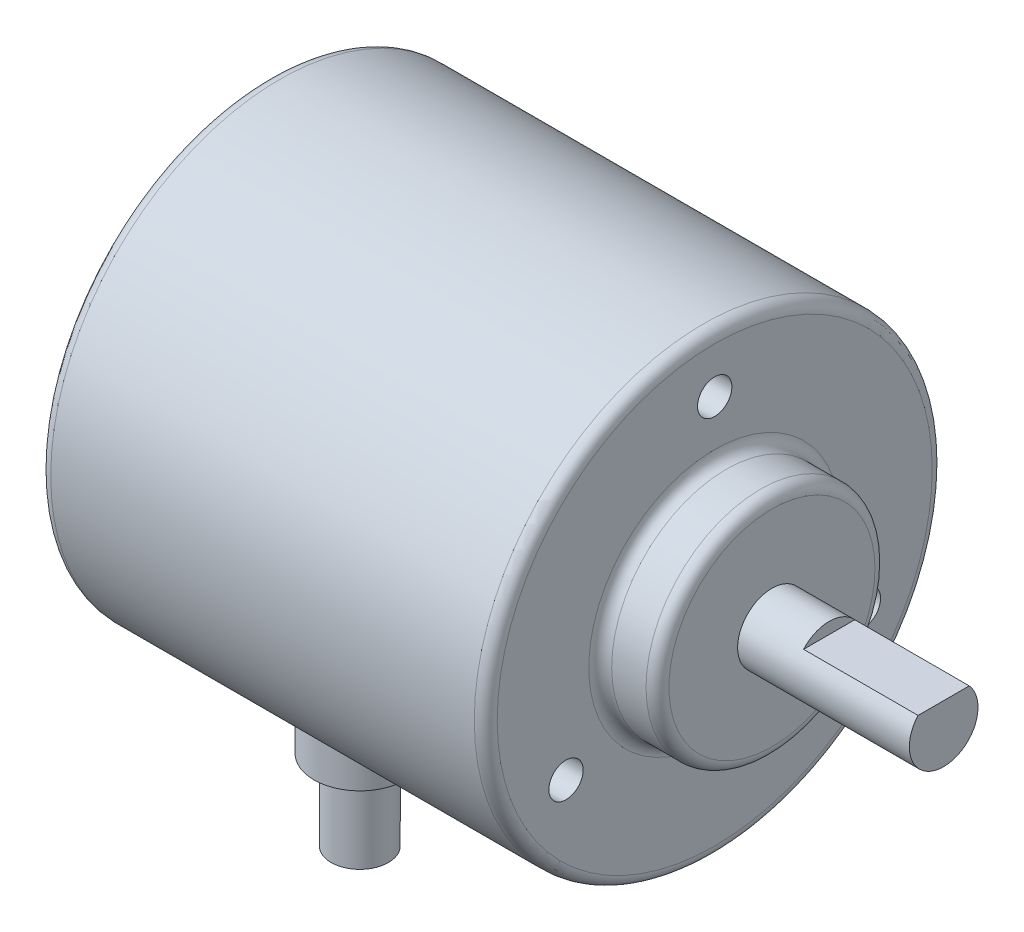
ISO-10303-21;
HEADER;
FILE_DESCRIPTION(('STEP AP214'),'2;1');
FILE_NAME('part.step','',(''),(''),'','','');
FILE_SCHEMA(('AUTOMOTIVE_DESIGN { 1 0 10303 214 1 1 1 1 }'));
ENDSEC;
DATA;
#1=APPLICATION_CONTEXT('core data for automotive mechanical design processes');
#2=APPLICATION_PROTOCOL_DEFINITION('international standard','automotive_design',2000,#1);
#3=PRODUCT_CONTEXT('',#1,'mechanical');
#4=PRODUCT('Part','Part','',(#3));
#5=PRODUCT_RELATED_PRODUCT_CATEGORY('part','',(#4));
#6=PRODUCT_DEFINITION_FORMATION('','',#4);
#7=PRODUCT_DEFINITION_CONTEXT('part definition',#1,'design');
#8=PRODUCT_DEFINITION('design','',#6,#7);
#9=PRODUCT_DEFINITION_SHAPE('','',#8);
#10=(LENGTH_UNIT() NAMED_UNIT(*) SI_UNIT(.MILLI.,.METRE.));
#11=(NAMED_UNIT(*) PLANE_ANGLE_UNIT() SI_UNIT($,.RADIAN.));
#12=(NAMED_UNIT(*) SI_UNIT($,.STERADIAN.) SOLID_ANGLE_UNIT());
#13=UNCERTAINTY_MEASURE_WITH_UNIT(LENGTH_MEASURE(1.E-05),#10,'distance_accuracy_value','');
#14=(GEOMETRIC_REPRESENTATION_CONTEXT(3) GLOBAL_UNCERTAINTY_ASSIGNED_CONTEXT((#13)) GLOBAL_UNIT_ASSIGNED_CONTEXT((#10,
#11,#12)) REPRESENTATION_CONTEXT('',''));
#15=CARTESIAN_POINT('',(0.,0.,0.));
#16=DIRECTION('',(0.,0.,1.));
#17=DIRECTION('',(1.,0.,0.));
#18=AXIS2_PLACEMENT_3D('',#15,#16,#17);
#19=CARTESIAN_POINT('',(39.,0.,0.));
#20=DIRECTION('',(-1.,0.,0.));
#21=DIRECTION('',(0.,0.,1.));
#22=AXIS2_PLACEMENT_3D('',#19,#20,#21);
#23=CYLINDRICAL_SURFACE('',#22,20.);
#24=CARTESIAN_POINT('',(1.,0.,0.));
#25=DIRECTION('',(1.,0.,0.));
#26=DIRECTION('',(0.,0.,-1.));
#27=AXIS2_PLACEMENT_3D('',#24,#25,#26);
#28=CIRCLE('',#27,20.);
#29=CARTESIAN_POINT('',(1.,0.,-20.));
#30=VERTEX_POINT('',#29);
#31=EDGE_CURVE('E170',#30,#30,#28,.T.);
#32=ORIENTED_EDGE('',*,*,#31,.T.);
#33=EDGE_LOOP('',(#32));
#34=FACE_BOUND('',#33,.T.);
#35=CARTESIAN_POINT('',(38.,0.,0.));
#36=DIRECTION('',(1.,0.,0.));
#37=DIRECTION('',(0.,0.,-1.));
#38=AXIS2_PLACEMENT_3D('',#35,#36,#37);
#39=CIRCLE('',#38,20.);
#40=CARTESIAN_POINT('',(38.,0.,-20.));
#41=VERTEX_POINT('',#40);
#42=EDGE_CURVE('E84',#41,#41,#39,.F.);
#43=ORIENTED_EDGE('',*,*,#42,.T.);
#44=EDGE_LOOP('',(#43));
#45=FACE_BOUND('',#44,.T.);
#46=CARTESIAN_POINT('',(9.28562013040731,-19.4633866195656,-4.60180196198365));
#47=CARTESIAN_POINT('',(9.07526862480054,-19.6404124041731,-3.85306889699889));
#48=CARTESIAN_POINT('',(9.02849610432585,-20.4365559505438,-3.86551364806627));
#49=CARTESIAN_POINT('',(9.01511911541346,-19.4471816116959,-4.67034633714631));
#50=CARTESIAN_POINT('',(8.85078145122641,-19.6284085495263,-3.91559139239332));
#51=CARTESIAN_POINT('',(8.81209529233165,-20.4195406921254,-3.92309092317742));
#52=CARTESIAN_POINT('',(8.73825597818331,-19.435737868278,-4.7172765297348));
#53=CARTESIAN_POINT('',(8.61888226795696,-19.6197970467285,-3.95891404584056));
#54=CARTESIAN_POINT('',(8.59060478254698,-20.4075247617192,-3.96251228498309));
#55=CARTESIAN_POINT('',(8.17994843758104,-19.423775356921,-4.76630042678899));
#56=CARTESIAN_POINT('',(8.15121764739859,-19.6108256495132,-4.00401183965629));
#57=CARTESIAN_POINT('',(8.1439587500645,-20.3949641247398,-4.00369235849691));
#58=CARTESIAN_POINT('',(7.89850476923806,-19.4232548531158,-4.7684012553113));
#59=CARTESIAN_POINT('',(7.91461822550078,-19.6104320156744,-4.00595672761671));
#60=CARTESIAN_POINT('',(7.91880381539,-20.3944175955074,-4.00545705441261));
#61=CARTESIAN_POINT('',(7.345971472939,-19.4330800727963,-4.72818962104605));
#62=CARTESIAN_POINT('',(7.4516628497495,-19.6178031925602,-3.96895813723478));
#63=CARTESIAN_POINT('',(7.47677717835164,-20.4047340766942,-3.97167928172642));
#64=CARTESIAN_POINT('',(7.07479322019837,-19.4431735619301,-4.68690812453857));
#65=CARTESIAN_POINT('',(7.22439344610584,-19.6254041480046,-3.93083578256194));
#66=CARTESIAN_POINT('',(7.25983457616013,-20.4153322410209,-3.93700282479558));
#67=CARTESIAN_POINT('',(6.54369398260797,-19.4726505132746,-4.56288303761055));
#68=CARTESIAN_POINT('',(6.78195391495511,-19.6473341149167,-3.81728972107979));
#69=CARTESIAN_POINT('',(6.83495518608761,-20.4462830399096,-3.83282175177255));
#70=CARTESIAN_POINT('',(6.28377356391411,-19.4920344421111,-4.48013736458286));
#71=CARTESIAN_POINT('',(6.5661448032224,-19.6617314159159,-3.74150011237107));
#72=CARTESIAN_POINT('',(6.62701885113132,-20.4666361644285,-3.76331538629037));
#73=CARTESIAN_POINT('',(5.78051878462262,-19.5380404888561,-4.27504684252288));
#74=CARTESIAN_POINT('',(6.15180958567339,-19.6953707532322,-3.55567595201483));
#75=CARTESIAN_POINT('',(6.22441502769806,-20.5149425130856,-3.59103934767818));
#76=CARTESIAN_POINT('',(5.53730488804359,-19.56470942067,-4.15244487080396));
#77=CARTESIAN_POINT('',(5.95302967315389,-19.7147248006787,-3.44491318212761));
#78=CARTESIAN_POINT('',(6.02984391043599,-20.5429448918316,-3.48805369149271));
#79=CARTESIAN_POINT('',(5.07559252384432,-19.6222761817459,-3.87127991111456));
#80=CARTESIAN_POINT('',(5.57963786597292,-19.7557247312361,-3.19414913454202));
#81=CARTESIAN_POINT('',(5.66047401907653,-20.6033899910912,-3.25187512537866));
#82=CARTESIAN_POINT('',(4.85709800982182,-19.6531746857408,-3.71271118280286));
#83=CARTESIAN_POINT('',(5.40495883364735,-19.7774294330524,-3.05362977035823));
#84=CARTESIAN_POINT('',(5.48567840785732,-20.6358334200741,-3.11867739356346));
#85=CARTESIAN_POINT('',(4.44503296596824,-19.7167082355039,-3.35922886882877));
#86=CARTESIAN_POINT('',(5.07940206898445,-19.8211458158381,-2.744787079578));
#87=CARTESIAN_POINT('',(5.15602637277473,-20.7025436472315,-2.82175224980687));
#88=CARTESIAN_POINT('',(4.25225796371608,-19.7493675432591,-3.16347766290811));
#89=CARTESIAN_POINT('',(4.92955389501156,-19.8431548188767,-2.57549055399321));
#90=CARTESIAN_POINT('',(5.00180637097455,-20.7368359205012,-2.65732123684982));
#91=CARTESIAN_POINT('',(3.90371575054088,-19.8120459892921,-2.74368403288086));
#92=CARTESIAN_POINT('',(4.66198800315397,-19.8844891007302,-2.21791230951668));
#93=CARTESIAN_POINT('',(4.72297260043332,-20.8026482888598,-2.30469458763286));
#94=CARTESIAN_POINT('',(3.74795016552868,-19.8420650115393,-2.51964036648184));
#95=CARTESIAN_POINT('',(4.54475774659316,-19.9037666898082,-2.0295319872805));
#96=CARTESIAN_POINT('',(4.59836013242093,-20.8341682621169,-2.1164979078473));
#97=CARTESIAN_POINT('',(3.47713911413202,-19.8962976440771,-2.04791196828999));
#98=CARTESIAN_POINT('',(4.3431121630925,-19.9379415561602,-1.63839581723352));
#99=CARTESIAN_POINT('',(4.38171129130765,-20.8911125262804,-1.72024605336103));
#100=CARTESIAN_POINT('',(3.36232578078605,-19.9204779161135,-1.80010226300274));
#101=CARTESIAN_POINT('',(4.25947522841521,-19.9527264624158,-1.43585830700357));
#102=CARTESIAN_POINT('',(4.2898606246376,-20.9165018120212,-1.51208590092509));
#103=CARTESIAN_POINT('',(3.17829264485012,-19.9600682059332,-1.28891716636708));
#104=CARTESIAN_POINT('',(4.12625139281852,-19.9766419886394,-1.02242100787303));
#105=CARTESIAN_POINT('',(4.14263411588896,-20.9580716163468,-1.08269041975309));
#106=CARTESIAN_POINT('',(3.1090652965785,-19.975479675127,-1.02554435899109));
#107=CARTESIAN_POINT('',(4.07716796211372,-19.9856858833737,-0.812174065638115));
#108=CARTESIAN_POINT('',(4.08725223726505,-20.9742536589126,-0.861457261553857));
#109=CARTESIAN_POINT('',(3.01954989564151,-19.995532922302,-0.497015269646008));
#110=CARTESIAN_POINT('',(4.01365033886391,-19.9974391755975,-0.392164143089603));
#111=CARTESIAN_POINT('',(4.01563991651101,-20.9953095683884,-0.417492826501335));
#112=CARTESIAN_POINT('',(2.99820226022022,-20.000407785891,-0.232030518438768));
#113=CARTESIAN_POINT('',(3.99873302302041,-20.0002365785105,-0.18333906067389));
#114=CARTESIAN_POINT('',(3.99856180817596,-21.0004281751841,-0.194905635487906));
#115=CARTESIAN_POINT('',(3.0020347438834,-19.9995384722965,0.297599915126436));
#116=CARTESIAN_POINT('',(4.00143376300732,-19.9997322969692,0.23510088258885));
#117=CARTESIAN_POINT('',(4.00162779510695,-20.9995153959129,0.249983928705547));
#118=CARTESIAN_POINT('',(3.02721039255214,-19.9937953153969,0.562245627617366));
#119=CARTESIAN_POINT('',(4.0190367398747,-19.9964334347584,0.443781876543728));
#120=CARTESIAN_POINT('',(4.02176831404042,-20.9934850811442,0.472286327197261));
#121=CARTESIAN_POINT('',(3.12248077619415,-19.9725009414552,1.0794540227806));
#122=CARTESIAN_POINT('',(4.08672604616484,-19.9839289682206,0.855246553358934));
#123=CARTESIAN_POINT('',(4.0979846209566,-20.9711259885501,0.906741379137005));
#124=CARTESIAN_POINT('',(3.19187955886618,-19.9571017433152,1.33213986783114));
#125=CARTESIAN_POINT('',(4.13603165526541,-19.9748657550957,1.0572510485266));
#126=CARTESIAN_POINT('',(4.15350364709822,-20.9549568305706,1.1189974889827));
#127=CARTESIAN_POINT('',(3.3727531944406,-19.9182841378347,1.82279291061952));
#128=CARTESIAN_POINT('',(4.26710519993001,-19.951380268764,1.45445988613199));
#129=CARTESIAN_POINT('',(4.29820255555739,-20.9141983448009,1.53114604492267));
#130=CARTESIAN_POINT('',(3.48423087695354,-19.8948651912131,2.06075911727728));
#131=CARTESIAN_POINT('',(4.34841554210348,-19.9370364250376,1.64909625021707));
#132=CARTESIAN_POINT('',(4.38738470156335,-20.8896084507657,1.73103765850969));
#133=CARTESIAN_POINT('',(3.74789810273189,-19.8420880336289,2.51904009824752));
#134=CARTESIAN_POINT('',(4.54475296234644,-19.9037739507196,2.02910129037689));
#135=CARTESIAN_POINT('',(4.59831848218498,-20.8341924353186,2.11599368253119));
#136=CARTESIAN_POINT('',(3.90065003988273,-19.8126492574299,2.7390518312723));
#137=CARTESIAN_POINT('',(4.65972027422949,-19.8848698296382,2.21406700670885));
#138=CARTESIAN_POINT('',(4.72052003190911,-20.8032817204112,2.30080353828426));
#139=CARTESIAN_POINT('',(4.24192395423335,-19.751176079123,3.15193490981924));
#140=CARTESIAN_POINT('',(4.92160104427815,-19.844354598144,2.56563561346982));
#141=CARTESIAN_POINT('',(4.99353916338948,-20.7387348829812,2.64762532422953));
#142=CARTESIAN_POINT('',(4.43045581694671,-19.7191409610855,3.34479872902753));
#143=CARTESIAN_POINT('',(5.06806184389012,-19.8227882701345,2.73232262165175));
#144=CARTESIAN_POINT('',(5.14436465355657,-20.7050980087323,2.80963093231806));
#145=CARTESIAN_POINT('',(4.84315154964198,-19.6551526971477,3.70254257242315));
#146=CARTESIAN_POINT('',(5.39376102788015,-19.7788232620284,3.04457764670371));
#147=CARTESIAN_POINT('',(5.47452123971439,-20.6379103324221,3.11013576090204));
#148=CARTESIAN_POINT('',(5.06804558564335,-19.623218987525,3.86666271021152));
#149=CARTESIAN_POINT('',(5.57347444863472,-19.7564019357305,3.1899943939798));
#150=CARTESIAN_POINT('',(5.65443646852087,-20.6043799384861,3.24799667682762));
#151=CARTESIAN_POINT('',(5.5440643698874,-19.5638648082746,4.15658248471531));
#152=CARTESIAN_POINT('',(5.95843706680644,-19.7141306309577,3.44855996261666));
#153=CARTESIAN_POINT('',(6.03525149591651,-20.5420580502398,3.49152928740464));
#154=CARTESIAN_POINT('',(5.79517240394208,-19.5364414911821,4.28240634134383));
#155=CARTESIAN_POINT('',(6.16374622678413,-19.6942151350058,3.56229087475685));
#156=CARTESIAN_POINT('',(6.23613792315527,-20.5132635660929,3.59722132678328));
#157=CARTESIAN_POINT('',(6.26971361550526,-19.4935541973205,4.47315270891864));
#158=CARTESIAN_POINT('',(6.55487216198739,-19.6628136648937,3.73531230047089));
#159=CARTESIAN_POINT('',(6.61577089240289,-20.468231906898,3.75744827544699));
#160=CARTESIAN_POINT('',(6.49000023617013,-19.4768263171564,4.54495880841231));
#161=CARTESIAN_POINT('',(6.73758767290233,-19.6504188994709,3.8009584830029));
#162=CARTESIAN_POINT('',(6.79200018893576,-20.4506676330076,3.8177653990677));
#163=CARTESIAN_POINT('',(6.93932279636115,-19.4499131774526,4.65878783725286));
#164=CARTESIAN_POINT('',(7.11150259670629,-19.6304258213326,3.90507561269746));
#165=CARTESIAN_POINT('',(7.1514582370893,-20.4224088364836,3.91338178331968));
#166=CARTESIAN_POINT('',(7.16835789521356,-19.4397272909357,4.70081362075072));
#167=CARTESIAN_POINT('',(7.30307740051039,-19.62278340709,3.94378628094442));
#168=CARTESIAN_POINT('',(7.33468631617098,-20.411713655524,3.94868344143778));
#169=CARTESIAN_POINT('',(7.67222074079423,-19.4256149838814,4.75884978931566));
#170=CARTESIAN_POINT('',(7.72478026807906,-19.6122139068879,3.99712496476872));
#171=CARTESIAN_POINT('',(7.73777659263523,-20.3968957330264,3.99743382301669));
#172=CARTESIAN_POINT('',(7.94788406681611,-19.4231415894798,4.76883110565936));
#173=CARTESIAN_POINT('',(7.95645628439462,-19.6103427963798,4.00636875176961));
#174=CARTESIAN_POINT('',(7.95830725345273,-20.3942986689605,4.0058181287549));
#175=CARTESIAN_POINT('',(8.49715233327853,-19.4288428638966,4.7455424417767));
#176=CARTESIAN_POINT('',(8.4168785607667,-19.6146226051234,3.98493366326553));
#177=CARTESIAN_POINT('',(8.39772186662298,-20.4002850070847,3.98625565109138));
#178=CARTESIAN_POINT('',(8.77075621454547,-19.4370226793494,4.71225155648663));
#179=CARTESIAN_POINT('',(8.64642951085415,-19.6207924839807,3.95416019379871));
#180=CARTESIAN_POINT('',(8.61660497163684,-20.4088738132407,3.95829130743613));
#181=CARTESIAN_POINT('',(9.3077885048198,-19.463051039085,4.60355569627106));
#182=CARTESIAN_POINT('',(9.09450727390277,-19.6402009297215,3.85451219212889));
#183=CARTESIAN_POINT('',(9.04623080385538,-20.4362035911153,3.86698678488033));
#184=CARTESIAN_POINT('',(9.57122542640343,-19.4808912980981,4.52818680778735));
#185=CARTESIAN_POINT('',(9.31372849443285,-19.6534958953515,3.78534178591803));
#186=CARTESIAN_POINT('',(9.25698034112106,-20.4549358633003,3.80367691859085));
#187=CARTESIAN_POINT('',(10.0809871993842,-19.5241802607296,4.33772502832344));
#188=CARTESIAN_POINT('',(9.7345255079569,-19.6852714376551,3.61237270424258));
#189=CARTESIAN_POINT('',(9.66478975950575,-20.5003892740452,3.64368902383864));
#190=CARTESIAN_POINT('',(10.3273113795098,-19.5496292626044,4.22263058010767));
#191=CARTESIAN_POINT('',(9.93654001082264,-19.7038336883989,3.50808176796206));
#192=CARTESIAN_POINT('',(9.86184910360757,-20.5271107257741,3.54700968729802));
#193=CARTESIAN_POINT('',(10.799753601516,-19.6057016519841,3.9541696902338));
#194=CARTESIAN_POINT('',(10.3200904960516,-19.7439959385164,3.26782748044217));
#195=CARTESIAN_POINT('',(10.2398028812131,-20.5859867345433,3.3215025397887));
#196=CARTESIAN_POINT('',(11.0255438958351,-19.6363919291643,3.80029442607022));
#197=CARTESIAN_POINT('',(10.501412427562,-19.7656987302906,3.13092303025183));
#198=CARTESIAN_POINT('',(10.4204351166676,-20.6182115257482,3.19224731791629));
#199=CARTESIAN_POINT('',(11.4472282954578,-19.6993255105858,3.45927398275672));
#200=CARTESIAN_POINT('',(10.8360409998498,-19.8092883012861,2.83181226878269));
#201=CARTESIAN_POINT('',(10.7577826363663,-20.6842917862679,2.90579014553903));
#202=CARTESIAN_POINT('',(11.6431182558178,-19.731569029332,3.27212419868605));
#203=CARTESIAN_POINT('',(10.989158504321,-19.8311952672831,2.66918633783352));
#204=CARTESIAN_POINT('',(10.9144946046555,-20.7181474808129,2.74858432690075));
#205=CARTESIAN_POINT('',(12.0038288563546,-19.7948311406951,2.86495214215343));
#206=CARTESIAN_POINT('',(11.267665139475,-19.87326956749,2.32058440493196));
#207=CARTESIAN_POINT('',(11.2030630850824,-20.7845726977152,2.40655979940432));
#208=CARTESIAN_POINT('',(12.1678736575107,-19.8258073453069,2.64429880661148));
#209=CARTESIAN_POINT('',(11.3918811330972,-19.8933449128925,2.13405636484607));
#210=CARTESIAN_POINT('',(11.3342989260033,-20.8170977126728,2.22121099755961));
#211=CARTESIAN_POINT('',(12.4547003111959,-19.8822974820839,2.1792280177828));
#212=CARTESIAN_POINT('',(11.6066309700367,-19.9292369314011,1.74656527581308));
#213=CARTESIAN_POINT('',(11.5637602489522,-20.8764123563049,1.83055153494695));
#214=CARTESIAN_POINT('',(12.5774843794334,-19.9078117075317,1.93481184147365));
#215=CARTESIAN_POINT('',(11.6965821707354,-19.9449715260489,1.54581400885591));
#216=CARTESIAN_POINT('',(11.6619875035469,-20.9032022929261,1.62524194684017));
#217=CARTESIAN_POINT('',(12.777166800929,-19.9503210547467,1.43108444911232));
#218=CARTESIAN_POINT('',(11.8417991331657,-19.9708288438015,1.13675150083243));
#219=CARTESIAN_POINT('',(11.8217334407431,-20.9478371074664,1.20211093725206));
#220=CARTESIAN_POINT('',(12.8544285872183,-19.9673834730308,1.17190983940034));
#221=CARTESIAN_POINT('',(11.896818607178,-19.9809080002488,0.929080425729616));
#222=CARTESIAN_POINT('',(11.8835428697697,-20.9657526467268,0.984404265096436));
#223=CARTESIAN_POINT('',(12.9620249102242,-19.9913566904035,0.644428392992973));
#224=CARTESIAN_POINT('',(11.9733913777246,-19.9950211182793,0.508833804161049));
#225=CARTESIAN_POINT('',(11.9696199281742,-20.990924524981,0.541319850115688));
#226=CARTESIAN_POINT('',(12.992367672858,-19.9982692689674,0.376123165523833));
#227=CARTESIAN_POINT('',(11.9946224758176,-19.9989962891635,0.297116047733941));
#228=CARTESIAN_POINT('',(11.9938941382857,-20.9981827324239,0.315943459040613));
#229=CARTESIAN_POINT('',(13.0049382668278,-20.0011198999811,-0.154972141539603));
#230=CARTESIAN_POINT('',(12.0034813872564,-20.000649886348,-0.122524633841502));
#231=CARTESIAN_POINT('',(12.0039506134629,-21.0011758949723,-0.130176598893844));
#232=CARTESIAN_POINT('',(12.988325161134,-19.9973223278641,-0.417736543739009));
#233=CARTESIAN_POINT('',(11.9918793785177,-19.9984726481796,-0.329498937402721));
#234=CARTESIAN_POINT('',(11.990660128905,-20.9971884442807,-0.350898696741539));
#235=CARTESIAN_POINT('',(12.9100250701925,-19.9797384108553,-0.936742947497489));
#236=CARTESIAN_POINT('',(11.93639082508,-19.9881870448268,-0.741471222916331));
#237=CARTESIAN_POINT('',(11.9280200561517,-20.9787253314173,-0.786864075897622));
#238=CARTESIAN_POINT('',(12.8483388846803,-19.965952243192,-1.19298506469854));
#239=CARTESIAN_POINT('',(11.8927375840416,-19.9801217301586,-0.945624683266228));
#240=CARTESIAN_POINT('',(11.8786711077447,-20.9642498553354,-1.00210745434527));
#241=CARTESIAN_POINT('',(12.6821711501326,-19.9299510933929,-1.69091806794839));
#242=CARTESIAN_POINT('',(11.7728374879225,-19.9584810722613,-1.34719728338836));
#243=CARTESIAN_POINT('',(11.7457369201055,-20.9264486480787,-1.42037117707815));
#244=CARTESIAN_POINT('',(12.5778376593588,-19.9077652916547,-1.93265601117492));
#245=CARTESIAN_POINT('',(11.6971427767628,-19.9450013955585,-1.54400754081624));
#246=CARTESIAN_POINT('',(11.6622701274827,-20.903153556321,-1.62343104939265));
#247=CARTESIAN_POINT('',(12.3294866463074,-19.8573093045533,-2.39618244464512));
#248=CARTESIAN_POINT('',(11.5131611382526,-19.9134474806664,-1.92662130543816));
#249=CARTESIAN_POINT('',(11.4635893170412,-20.8501747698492,-2.01279325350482));
#250=CARTESIAN_POINT('',(12.1854637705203,-19.8290382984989,-2.61796823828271));
#251=CARTESIAN_POINT('',(11.4053960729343,-19.8954529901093,-2.11211178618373));
#252=CARTESIAN_POINT('',(11.348371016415,-20.8204902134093,-2.1990933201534));
#253=CARTESIAN_POINT('',(11.8580170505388,-19.7686846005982,-3.04068587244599));
#254=CARTESIAN_POINT('',(11.1555667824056,-19.8560110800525,-2.47022714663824));
#255=CARTESIAN_POINT('',(11.0864136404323,-20.7571188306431,-2.5541761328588));
#256=CARTESIAN_POINT('',(11.6737784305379,-19.736530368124,-3.24103512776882));
#257=CARTESIAN_POINT('',(11.0132511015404,-19.8345451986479,-2.64254106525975));
#258=CARTESIAN_POINT('',(10.9390227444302,-20.7233568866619,-2.72246950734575));
#259=CARTESIAN_POINT('',(11.2728388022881,-19.6724306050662,-3.60978927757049));
#260=CARTESIAN_POINT('',(10.6982936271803,-19.7908076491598,-2.96309481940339));
#261=CARTESIAN_POINT('',(10.6182710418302,-20.6560521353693,-3.03222299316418));
#262=CARTESIAN_POINT('',(11.0561339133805,-19.6404850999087,-3.77819034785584));
#263=CARTESIAN_POINT('',(10.5259465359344,-19.7685375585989,-3.11166947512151));
#264=CARTESIAN_POINT('',(10.4449071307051,-20.6225093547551,-3.17367989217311));
#265=CARTESIAN_POINT('',(10.5923378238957,-19.5798671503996,-4.0808157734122));
#266=CARTESIAN_POINT('',(10.1524421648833,-19.7256294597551,-3.38057040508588));
#267=CARTESIAN_POINT('',(10.0738702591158,-20.558860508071,-3.42788524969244));
#268=CARTESIAN_POINT('',(10.3448300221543,-19.5512526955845,-4.21447379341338));
#269=CARTESIAN_POINT('',(9.95084009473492,-19.7049629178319,-3.50099321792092));
#270=CARTESIAN_POINT('',(9.87586401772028,-20.5288153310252,-3.54015798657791));
#271=CARTESIAN_POINT('',(9.82894404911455,-19.5012486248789,-4.44012848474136));
#272=CARTESIAN_POINT('',(9.52715404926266,-19.6685332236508,-3.70500178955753));
#273=CARTESIAN_POINT('',(9.4631552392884,-20.4763110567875,-3.72970792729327));
#274=CARTESIAN_POINT('',(9.56056861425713,-19.4798580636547,-4.5321306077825));
#275=CARTESIAN_POINT('',(9.30469681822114,-19.652680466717,-3.78917026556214));
#276=CARTESIAN_POINT('',(9.24845489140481,-20.4538509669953,-3.8069897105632));
#277=CARTESIAN_POINT('',(9.28562013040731,-19.4633866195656,-4.60180196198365));
#278=CARTESIAN_POINT('',(9.07526862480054,-19.6404124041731,-3.85306889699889));
#279=CARTESIAN_POINT('',(9.02849610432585,-20.4365559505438,-3.86551364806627));
#280=(BOUNDED_SURFACE() B_SPLINE_SURFACE(3,2,((#46,#47,#48),(#49,#50,#51),(#52,#53,#54),(#55,
#56,#57),(#58,#59,#60),(#61,#62,#63),(#64,#65,#66),(#67,#68,#69),(#70,#71,#72),(#73,#74,#75),
(#76,#77,#78),(#79,#80,#81),(#82,#83,#84),(#85,#86,#87),(#88,#89,#90),(#91,#92,#93),(#94,#95,
#96),(#97,#98,#99),(#100,#101,#102),(#103,#104,#105),(#106,#107,#108),(#109,#110,#111),(#112,
#113,#114),(#115,#116,#117),(#118,#119,#120),(#121,#122,#123),(#124,#125,#126),(#127,#128,#129),
(#130,#131,#132),(#133,#134,#135),(#136,#137,#138),(#139,#140,#141),(#142,#143,#144),(#145,#146,
#147),(#148,#149,#150),(#151,#152,#153),(#154,#155,#156),(#157,#158,#159),(#160,#161,#162),
(#163,#164,#165),(#166,#167,#168),(#169,#170,#171),(#172,#173,#174),(#175,#176,#177),(#178,#179,
#180),(#181,#182,#183),(#184,#185,#186),(#187,#188,#189),(#190,#191,#192),(#193,#194,#195),
(#196,#197,#198),(#199,#200,#201),(#202,#203,#204),(#205,#206,#207),(#208,#209,#210),(#211,#212,
#213),(#214,#215,#216),(#217,#218,#219),(#220,#221,#222),(#223,#224,#225),(#226,#227,#228),
(#229,#230,#231),(#232,#233,#234),(#235,#236,#237),(#238,#239,#240),(#241,#242,#243),(#244,#245,
#246),(#247,#248,#249),(#250,#251,#252),(#253,#254,#255),(#256,#257,#258),(#259,#260,#261),
(#262,#263,#264),(#265,#266,#267),(#268,#269,#270),(#271,#272,#273),(#274,#275,#276),(#277,#278,
#279)),.UNSPECIFIED.,.T.,.F.,.F.) B_SPLINE_SURFACE_WITH_KNOTS((4,2,2,2,2,2,2,2,2,2,2,2,2,2,2,2,
2,2,2,2,2,2,2,2,2,2,2,2,2,2,2,2,2,2,2,2,2,2,4),(3,3),(0.,0.840250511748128,1.68036749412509,
2.5009613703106,3.32159646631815,4.14763438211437,4.97380422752,5.8214499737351,6.6691329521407,
7.52154729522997,8.37382050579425,9.20703852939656,10.0401764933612,10.8605164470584,
11.6809115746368,12.5131041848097,13.3455270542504,14.1974164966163,15.0487660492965,
15.7469795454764,16.4451261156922,17.268678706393,18.0926293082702,18.9158743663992,
19.7391516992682,20.5738509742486,21.4086658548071,22.2617941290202,23.1148765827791,
23.9610526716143,24.8070803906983,25.632408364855,26.4577216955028,27.2801938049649,
28.1027769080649,28.9438972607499,29.7851182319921,30.639295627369,31.4933611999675),(0.,1.),
.UNSPECIFIED.) GEOMETRIC_REPRESENTATION_ITEM() RATIONAL_B_SPLINE_SURFACE(((1.,0.781778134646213,
1.),(1.,0.783896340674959,1.),(1.,0.785381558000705,1.),(1.,0.786933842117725,1.),(1.,
0.787001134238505,1.),(1.,0.785726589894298,1.),(1.,0.784417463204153,1.),(1.,0.780569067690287,
1.),(1.,0.778029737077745,1.),(1.,0.771947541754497,1.),(1.,0.768398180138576,1.),(1.,
0.760652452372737,1.),(1.,0.75645598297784,1.),(1.,0.747726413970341,1.),(1.,0.743187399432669,
1.),(1.,0.734376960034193,1.),(1.,0.730105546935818,1.),(1.,0.722315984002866,1.),(1.,
0.718802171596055,1.),(1.,0.713013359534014,1.),(1.,0.710738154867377,1.),(1.,0.707771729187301,
1.),(1.,0.707046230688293,1.),(1.,0.707175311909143,1.),(1.,0.708029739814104,1.),(1.,
0.711177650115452,1.),(1.,0.713448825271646,1.),(1.,0.71912103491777,1.),(1.,0.722522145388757,
1.),(1.,0.730101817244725,1.),(1.,0.734290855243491,1.),(1.,0.742934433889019,1.),(1.,
0.747389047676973,1.),(1.,0.756187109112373,1.),(1.,0.760525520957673,1.),(1.,0.768511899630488,
1.),(1.,0.77216030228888,1.),(1.,0.777827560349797,1.),(1.,0.780021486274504,1.),(1.,
0.783539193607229,1.),(1.,0.784863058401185,1.),(1.,0.78669579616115,1.),(1.,0.787015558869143,
1.),(1.,0.786276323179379,1.),(1.,0.785216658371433,1.),(1.,0.78182430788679,1.),(1.,
0.77949271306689,1.),(1.,0.773785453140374,1.),(1.,0.770409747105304,1.),(1.,0.762892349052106,
1.),(1.,0.758740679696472,1.),(1.,0.75012710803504,1.),(1.,0.745665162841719,1.),(1.,
0.736810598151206,1.),(1.,0.732421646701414,1.),(1.,0.724337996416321,1.),(1.,0.72064326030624,
1.),(1.,0.714445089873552,1.),(1.,0.711932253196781,1.),(1.,0.708391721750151,1.),(1.,
0.707363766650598,1.),(1.,0.706940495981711,1.),(1.,0.707505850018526,1.),(1.,0.710108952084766,
1.),(1.,0.712146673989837,1.),(1.,0.717420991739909,1.),(1.,0.720653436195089,1.),(1.,
0.727924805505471,1.),(1.,0.731963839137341,1.),(1.,0.74048541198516,1.),(1.,0.744975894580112,
1.),(1.,0.753824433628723,1.),(1.,0.75818247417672,1.),(1.,0.766370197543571,1.),(1.,
0.770190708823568,1.),(1.,0.776818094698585,1.),(1.,0.779625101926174,1.),(1.,0.781778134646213,1.))) REPRESENTATION_ITEM('') SURFACE());
#281=CARTESIAN_POINT('',(9.28562013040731,-19.4633866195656,-4.60180196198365));
#282=CARTESIAN_POINT('',(9.01511911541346,-19.4471816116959,-4.67034633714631));
#283=CARTESIAN_POINT('',(8.73825597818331,-19.435737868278,-4.7172765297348));
#284=CARTESIAN_POINT('',(8.17994843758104,-19.423775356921,-4.76630042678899));
#285=CARTESIAN_POINT('',(7.89850476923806,-19.4232548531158,-4.7684012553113));
#286=CARTESIAN_POINT('',(7.345971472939,-19.4330800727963,-4.72818962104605));
#287=CARTESIAN_POINT('',(7.07479322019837,-19.4431735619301,-4.68690812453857));
#288=CARTESIAN_POINT('',(6.54369398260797,-19.4726505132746,-4.56288303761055));
#289=CARTESIAN_POINT('',(6.28377356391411,-19.4920344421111,-4.48013736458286));
#290=CARTESIAN_POINT('',(5.78051878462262,-19.5380404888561,-4.27504684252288));
#291=CARTESIAN_POINT('',(5.53730488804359,-19.56470942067,-4.15244487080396));
#292=CARTESIAN_POINT('',(5.07559252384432,-19.6222761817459,-3.87127991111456));
#293=CARTESIAN_POINT('',(4.85709800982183,-19.6531746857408,-3.71271118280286));
#294=CARTESIAN_POINT('',(4.44503296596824,-19.7167082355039,-3.35922886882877));
#295=CARTESIAN_POINT('',(4.25225796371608,-19.7493675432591,-3.16347766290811));
#296=CARTESIAN_POINT('',(3.90371575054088,-19.8120459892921,-2.74368403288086));
#297=CARTESIAN_POINT('',(3.74795016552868,-19.8420650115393,-2.51964036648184));
#298=CARTESIAN_POINT('',(3.47713911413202,-19.8962976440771,-2.04791196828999));
#299=CARTESIAN_POINT('',(3.36232578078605,-19.9204779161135,-1.80010226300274));
#300=CARTESIAN_POINT('',(3.17829264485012,-19.9600682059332,-1.28891716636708));
#301=CARTESIAN_POINT('',(3.1090652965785,-19.975479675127,-1.02554435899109));
#302=CARTESIAN_POINT('',(3.01954989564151,-19.995532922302,-0.497015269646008));
#303=CARTESIAN_POINT('',(2.99820226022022,-20.000407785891,-0.232030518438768));
#304=CARTESIAN_POINT('',(3.0020347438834,-19.9995384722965,0.297599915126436));
#305=CARTESIAN_POINT('',(3.02721039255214,-19.9937953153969,0.562245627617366));
#306=CARTESIAN_POINT('',(3.12248077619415,-19.9725009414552,1.0794540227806));
#307=CARTESIAN_POINT('',(3.19187955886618,-19.9571017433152,1.33213986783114));
#308=CARTESIAN_POINT('',(3.3727531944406,-19.9182841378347,1.82279291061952));
#309=CARTESIAN_POINT('',(3.48423087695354,-19.8948651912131,2.06075911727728));
#310=CARTESIAN_POINT('',(3.74789810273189,-19.8420880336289,2.51904009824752));
#311=CARTESIAN_POINT('',(3.90065003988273,-19.8126492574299,2.7390518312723));
#312=CARTESIAN_POINT('',(4.24192395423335,-19.751176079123,3.15193490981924));
#313=CARTESIAN_POINT('',(4.43045581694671,-19.7191409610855,3.34479872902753));
#314=CARTESIAN_POINT('',(4.84315154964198,-19.6551526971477,3.70254257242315));
#315=CARTESIAN_POINT('',(5.06804558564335,-19.623218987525,3.86666271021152));
#316=CARTESIAN_POINT('',(5.5440643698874,-19.5638648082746,4.15658248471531));
#317=CARTESIAN_POINT('',(5.79517240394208,-19.5364414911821,4.28240634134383));
#318=CARTESIAN_POINT('',(6.26971361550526,-19.4935541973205,4.47315270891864));
#319=CARTESIAN_POINT('',(6.49000023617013,-19.4768263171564,4.54495880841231));
#320=CARTESIAN_POINT('',(6.93932279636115,-19.4499131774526,4.65878783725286));
#321=CARTESIAN_POINT('',(7.16835789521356,-19.4397272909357,4.70081362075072));
#322=CARTESIAN_POINT('',(7.67222074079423,-19.4256149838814,4.75884978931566));
#323=CARTESIAN_POINT('',(7.94788406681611,-19.4231415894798,4.76883110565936));
#324=CARTESIAN_POINT('',(8.49715233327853,-19.4288428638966,4.7455424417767));
#325=CARTESIAN_POINT('',(8.77075621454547,-19.4370226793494,4.71225155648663));
#326=CARTESIAN_POINT('',(9.3077885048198,-19.463051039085,4.60355569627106));
#327=CARTESIAN_POINT('',(9.57122542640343,-19.4808912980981,4.52818680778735));
#328=CARTESIAN_POINT('',(10.0809871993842,-19.5241802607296,4.33772502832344));
#329=CARTESIAN_POINT('',(10.3273113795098,-19.5496292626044,4.22263058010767));
#330=CARTESIAN_POINT('',(10.799753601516,-19.6057016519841,3.9541696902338));
#331=CARTESIAN_POINT('',(11.0255438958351,-19.6363919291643,3.80029442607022));
#332=CARTESIAN_POINT('',(11.4472282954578,-19.6993255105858,3.45927398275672));
#333=CARTESIAN_POINT('',(11.6431182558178,-19.731569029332,3.27212419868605));
#334=CARTESIAN_POINT('',(12.0038288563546,-19.7948311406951,2.86495214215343));
#335=CARTESIAN_POINT('',(12.1678736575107,-19.8258073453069,2.64429880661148));
#336=CARTESIAN_POINT('',(12.4547003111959,-19.8822974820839,2.1792280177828));
#337=CARTESIAN_POINT('',(12.5774843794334,-19.9078117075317,1.93481184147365));
#338=CARTESIAN_POINT('',(12.777166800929,-19.9503210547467,1.43108444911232));
#339=CARTESIAN_POINT('',(12.8544285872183,-19.9673834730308,1.17190983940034));
#340=CARTESIAN_POINT('',(12.9620249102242,-19.9913566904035,0.644428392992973));
#341=CARTESIAN_POINT('',(12.992367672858,-19.9982692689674,0.376123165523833));
#342=CARTESIAN_POINT('',(13.0049382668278,-20.0011198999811,-0.154972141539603));
#343=CARTESIAN_POINT('',(12.988325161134,-19.9973223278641,-0.417736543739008));
#344=CARTESIAN_POINT('',(12.9100250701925,-19.9797384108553,-0.936742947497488));
#345=CARTESIAN_POINT('',(12.8483388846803,-19.965952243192,-1.19298506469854));
#346=CARTESIAN_POINT('',(12.6821711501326,-19.9299510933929,-1.69091806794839));
#347=CARTESIAN_POINT('',(12.5778376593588,-19.9077652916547,-1.93265601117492));
#348=CARTESIAN_POINT('',(12.3294866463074,-19.8573093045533,-2.39618244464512));
#349=CARTESIAN_POINT('',(12.1854637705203,-19.8290382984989,-2.61796823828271));
#350=CARTESIAN_POINT('',(11.8580170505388,-19.7686846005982,-3.04068587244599));
#351=CARTESIAN_POINT('',(11.6737784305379,-19.736530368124,-3.24103512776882));
#352=CARTESIAN_POINT('',(11.2728388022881,-19.6724306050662,-3.60978927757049));
#353=CARTESIAN_POINT('',(11.0561339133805,-19.6404850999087,-3.77819034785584));
#354=CARTESIAN_POINT('',(10.5923378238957,-19.5798671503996,-4.0808157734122));
#355=CARTESIAN_POINT('',(10.3448300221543,-19.5512526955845,-4.21447379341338));
#356=CARTESIAN_POINT('',(9.82894404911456,-19.5012486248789,-4.44012848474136));
#357=CARTESIAN_POINT('',(9.56056861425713,-19.4798580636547,-4.5321306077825));
#358=CARTESIAN_POINT('',(9.28562013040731,-19.4633866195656,-4.60180196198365));
#359=B_SPLINE_CURVE_WITH_KNOTS('',3,(#281,#282,#283,#284,#285,#286,#287,#288,#289,#290,#291,
#292,#293,#294,#295,#296,#297,#298,#299,#300,#301,#302,#303,#304,#305,#306,#307,#308,#309,#310,
#311,#312,#313,#314,#315,#316,#317,#318,#319,#320,#321,#322,#323,#324,#325,#326,#327,#328,#329,
#330,#331,#332,#333,#334,#335,#336,#337,#338,#339,#340,#341,#342,#343,#344,#345,#346,#347,#348,
#349,#350,#351,#352,#353,#354,#355,#356,#357,#358),.UNSPECIFIED.,.T.,.F.,(4,2,2,2,2,2,2,2,2,2,2,
2,2,2,2,2,2,2,2,2,2,2,2,2,2,2,2,2,2,2,2,2,2,2,2,2,2,2,4),(0.,0.840250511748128,1.68036749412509,
2.5009613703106,3.32159646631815,4.14763438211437,4.97380422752,5.8214499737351,6.6691329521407,
7.52154729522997,8.37382050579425,9.20703852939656,10.0401764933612,10.8605164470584,
11.6809115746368,12.5131041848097,13.3455270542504,14.1974164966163,15.0487660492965,
15.7469795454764,16.4451261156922,17.268678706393,18.0926293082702,18.9158743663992,
19.7391516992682,20.5738509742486,21.4086658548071,22.2617941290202,23.1148765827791,
23.9610526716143,24.8070803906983,25.632408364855,26.4577216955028,27.2801938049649,
28.1027769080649,28.9438972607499,29.7851182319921,30.639295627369,31.4933611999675),.UNSPECIFIED.);
#360=CARTESIAN_POINT('',(9.28562013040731,-19.4633866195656,-4.60180196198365));
#361=VERTEX_POINT('',#360);
#362=EDGE_CURVE('E81',#361,#361,#359,.T.);
#363=ORIENTED_EDGE('',*,*,#362,.T.);
#364=EDGE_LOOP('',(#363));
#365=FACE_BOUND('',#364,.T.);
#366=ADVANCED_FACE('F34',(#34,#45,#365),#23,.T.);
#367=CARTESIAN_POINT('',(39.,0.,0.));
#368=DIRECTION('',(1.,0.,0.));
#369=DIRECTION('',(0.,0.,-1.));
#370=AXIS2_PLACEMENT_3D('',#367,#368,#369);
#371=PLANE('',#370);
#372=CARTESIAN_POINT('',(39.,0.,0.));
#373=DIRECTION('',(1.,0.,0.));
#374=DIRECTION('',(0.,0.,-1.));
#375=AXIS2_PLACEMENT_3D('',#372,#373,#374);
#376=CIRCLE('',#375,19.);
#377=CARTESIAN_POINT('',(39.,0.,-19.));
#378=VERTEX_POINT('',#377);
#379=EDGE_CURVE('E131',#378,#378,#376,.T.);
#380=ORIENTED_EDGE('',*,*,#379,.T.);
#381=EDGE_LOOP('',(#380));
#382=FACE_BOUND('',#381,.T.);
#383=CARTESIAN_POINT('',(39.,0.,0.));
#384=DIRECTION('',(1.,0.,0.));
#385=DIRECTION('',(0.,0.,-1.));
#386=AXIS2_PLACEMENT_3D('',#383,#384,#385);
#387=CIRCLE('',#386,11.);
#388=CARTESIAN_POINT('',(39.,0.,-11.));
#389=VERTEX_POINT('',#388);
#390=EDGE_CURVE('E179',#389,#389,#387,.F.);
#391=ORIENTED_EDGE('',*,*,#390,.T.);
#392=EDGE_LOOP('',(#391));
#393=FACE_BOUND('',#392,.T.);
#394=CARTESIAN_POINT('',(39.,-7.49999999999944,-12.9903810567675));
#395=DIRECTION('',(1.,0.,0.));
#396=DIRECTION('',(0.,0.,-1.));
#397=AXIS2_PLACEMENT_3D('',#394,#395,#396);
#398=CIRCLE('',#397,1.50000000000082);
#399=CARTESIAN_POINT('',(39.,-7.49999999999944,-14.4903810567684));
#400=VERTEX_POINT('',#399);
#401=EDGE_CURVE('E250',#400,#400,#398,.T.);
#402=ORIENTED_EDGE('',*,*,#401,.F.);
#403=EDGE_LOOP('',(#402));
#404=FACE_BOUND('',#403,.T.);
#405=CARTESIAN_POINT('',(39.,-7.50000000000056,12.9903810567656));
#406=DIRECTION('',(1.,0.,0.));
#407=DIRECTION('',(0.,0.,-1.));
#408=AXIS2_PLACEMENT_3D('',#405,#406,#407);
#409=CIRCLE('',#408,1.50000000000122);
#410=CARTESIAN_POINT('',(39.,-7.50000000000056,11.4903810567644));
#411=VERTEX_POINT('',#410);
#412=EDGE_CURVE('E257',#411,#411,#409,.T.);
#413=ORIENTED_EDGE('',*,*,#412,.F.);
#414=EDGE_LOOP('',(#413));
#415=FACE_BOUND('',#414,.T.);
#416=CARTESIAN_POINT('',(39.,15.,0.));
#417=DIRECTION('',(1.,0.,0.));
#418=DIRECTION('',(0.,0.,-1.));
#419=AXIS2_PLACEMENT_3D('',#416,#417,#418);
#420=CIRCLE('',#419,1.5);
#421=CARTESIAN_POINT('',(39.,15.,-1.5));
#422=VERTEX_POINT('',#421);
#423=EDGE_CURVE('E254',#422,#422,#420,.T.);
#424=ORIENTED_EDGE('',*,*,#423,.F.);
#425=EDGE_LOOP('',(#424));
#426=FACE_BOUND('',#425,.T.);
#427=ADVANCED_FACE('F159',(#382,#393,#404,#415,#426),#371,.T.);
#428=CARTESIAN_POINT('',(0.,0.,0.));
#429=DIRECTION('',(1.,0.,0.));
#430=DIRECTION('',(0.,0.,-1.));
#431=AXIS2_PLACEMENT_3D('',#428,#429,#430);
#432=PLANE('',#431);
#433=CARTESIAN_POINT('',(0.,0.,0.));
#434=DIRECTION('',(1.,0.,0.));
#435=DIRECTION('',(0.,0.,-1.));
#436=AXIS2_PLACEMENT_3D('',#433,#434,#435);
#437=CIRCLE('',#436,19.);
#438=CARTESIAN_POINT('',(0.,0.,-19.));
#439=VERTEX_POINT('',#438);
#440=EDGE_CURVE('E177',#439,#439,#437,.F.);
#441=ORIENTED_EDGE('',*,*,#440,.T.);
#442=EDGE_LOOP('',(#441));
#443=FACE_BOUND('',#442,.T.);
#444=ADVANCED_FACE('F164',(#443),#432,.F.);
#445=CARTESIAN_POINT('',(44.,0.,0.));
#446=DIRECTION('',(-1.,0.,0.));
#447=DIRECTION('',(0.,0.,1.));
#448=AXIS2_PLACEMENT_3D('',#445,#446,#447);
#449=CYLINDRICAL_SURFACE('',#448,10.);
#450=CARTESIAN_POINT('',(40.,0.,0.));
#451=DIRECTION('',(1.,0.,0.));
#452=DIRECTION('',(0.,0.,-1.));
#453=AXIS2_PLACEMENT_3D('',#450,#451,#452);
#454=CIRCLE('',#453,10.);
#455=CARTESIAN_POINT('',(40.,0.,-10.));
#456=VERTEX_POINT('',#455);
#457=EDGE_CURVE('E47',#456,#456,#454,.T.);
#458=ORIENTED_EDGE('',*,*,#457,.T.);
#459=EDGE_LOOP('',(#458));
#460=FACE_BOUND('',#459,.T.);
#461=CARTESIAN_POINT('',(43.,0.,0.));
#462=DIRECTION('',(1.,0.,0.));
#463=DIRECTION('',(0.,0.,-1.));
#464=AXIS2_PLACEMENT_3D('',#461,#462,#463);
#465=CIRCLE('',#464,10.);
#466=CARTESIAN_POINT('',(43.,0.,-10.));
#467=VERTEX_POINT('',#466);
#468=EDGE_CURVE('E138',#467,#467,#465,.F.);
#469=ORIENTED_EDGE('',*,*,#468,.T.);
#470=EDGE_LOOP('',(#469));
#471=FACE_BOUND('',#470,.T.);
#472=ADVANCED_FACE('F144',(#460,#471),#449,.T.);
#473=CARTESIAN_POINT('',(44.,0.,0.));
#474=DIRECTION('',(1.,0.,0.));
#475=DIRECTION('',(0.,0.,-1.));
#476=AXIS2_PLACEMENT_3D('',#473,#474,#475);
#477=PLANE('',#476);
#478=CARTESIAN_POINT('',(44.,0.,0.));
#479=DIRECTION('',(1.,0.,0.));
#480=DIRECTION('',(0.,0.,-1.));
#481=AXIS2_PLACEMENT_3D('',#478,#479,#480);
#482=CIRCLE('',#481,9.);
#483=CARTESIAN_POINT('',(44.,0.,-9.));
#484=VERTEX_POINT('',#483);
#485=EDGE_CURVE('E11',#484,#484,#482,.T.);
#486=ORIENTED_EDGE('',*,*,#485,.T.);
#487=EDGE_LOOP('',(#486));
#488=FACE_BOUND('',#487,.T.);
#489=CARTESIAN_POINT('',(44.,0.,0.));
#490=DIRECTION('',(1.,0.,0.));
#491=DIRECTION('',(0.,0.,-1.));
#492=AXIS2_PLACEMENT_3D('',#489,#490,#491);
#493=CIRCLE('',#492,3.);
#494=CARTESIAN_POINT('',(44.,0.,-3.));
#495=VERTEX_POINT('',#494);
#496=EDGE_CURVE('E78',#495,#495,#493,.T.);
#497=ORIENTED_EDGE('',*,*,#496,.F.);
#498=EDGE_LOOP('',(#497));
#499=FACE_BOUND('',#498,.T.);
#500=ADVANCED_FACE('F206',(#488,#499),#477,.T.);
#501=CARTESIAN_POINT('',(59.,0.,0.));
#502=DIRECTION('',(-1.,0.,0.));
#503=DIRECTION('',(0.,0.,1.));
#504=AXIS2_PLACEMENT_3D('',#501,#502,#503);
#505=CYLINDRICAL_SURFACE('',#504,3.);
#506=CARTESIAN_POINT('',(59.,0.,0.));
#507=DIRECTION('',(1.,0.,0.));
#508=DIRECTION('',(0.,0.,-1.));
#509=AXIS2_PLACEMENT_3D('',#506,#507,#508);
#510=CIRCLE('',#509,3.);
#511=CARTESIAN_POINT('',(59.,2.,2.23606797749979));
#512=VERTEX_POINT('',#511);
#513=CARTESIAN_POINT('',(59.,2.,-2.23606797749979));
#514=VERTEX_POINT('',#513);
#515=EDGE_CURVE('E77',#512,#514,#510,.T.);
#516=ORIENTED_EDGE('',*,*,#515,.F.);
#517=DIRECTION('',(1.,0.,0.));
#518=VECTOR('',#517,1.);
#519=CARTESIAN_POINT('',(49.,2.,2.23606797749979));
#520=LINE('',#519,#518);
#521=CARTESIAN_POINT('',(49.,2.,2.23606797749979));
#522=VERTEX_POINT('',#521);
#523=EDGE_CURVE('E54',#522,#512,#520,.T.);
#524=ORIENTED_EDGE('',*,*,#523,.F.);
#525=CARTESIAN_POINT('',(49.,0.,0.));
#526=DIRECTION('',(1.,0.,0.));
#527=DIRECTION('',(0.,0.,-1.));
#528=AXIS2_PLACEMENT_3D('',#525,#526,#527);
#529=CIRCLE('',#528,3.);
#530=CARTESIAN_POINT('',(49.,2.,-2.23606797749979));
#531=VERTEX_POINT('',#530);
#532=EDGE_CURVE('E70',#531,#522,#529,.T.);
#533=ORIENTED_EDGE('',*,*,#532,.F.);
#534=DIRECTION('',(1.,0.,0.));
#535=VECTOR('',#534,1.);
#536=CARTESIAN_POINT('',(49.,2.,-2.23606797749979));
#537=LINE('',#536,#535);
#538=EDGE_CURVE('E60',#531,#514,#537,.T.);
#539=ORIENTED_EDGE('',*,*,#538,.T.);
#540=EDGE_LOOP('',(#516,#524,#533,#539));
#541=FACE_BOUND('',#540,.T.);
#542=ORIENTED_EDGE('',*,*,#496,.T.);
#543=EDGE_LOOP('',(#542));
#544=FACE_BOUND('',#543,.T.);
#545=ADVANCED_FACE('F75',(#541,#544),#505,.T.);
#546=CARTESIAN_POINT('',(59.,0.,0.));
#547=DIRECTION('',(1.,0.,0.));
#548=DIRECTION('',(0.,0.,-1.));
#549=AXIS2_PLACEMENT_3D('',#546,#547,#548);
#550=PLANE('',#549);
#551=DIRECTION('',(0.,0.,-1.));
#552=VECTOR('',#551,1.);
#553=CARTESIAN_POINT('',(59.,2.,2.23606797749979));
#554=LINE('',#553,#552);
#555=EDGE_CURVE('E65',#512,#514,#554,.T.);
#556=ORIENTED_EDGE('',*,*,#555,.F.);
#557=ORIENTED_EDGE('',*,*,#515,.T.);
#558=EDGE_LOOP('',(#556,#557));
#559=FACE_BOUND('',#558,.T.);
#560=ADVANCED_FACE('F80',(#559),#550,.T.);
#561=CARTESIAN_POINT('',(49.,2.,2.23606797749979));
#562=DIRECTION('',(0.,-1.,0.));
#563=DIRECTION('',(0.,0.,-1.));
#564=AXIS2_PLACEMENT_3D('',#561,#562,#563);
#565=PLANE('',#564);
#566=ORIENTED_EDGE('',*,*,#555,.T.);
#567=ORIENTED_EDGE('',*,*,#538,.F.);
#568=DIRECTION('',(0.,0.,-1.));
#569=VECTOR('',#568,1.);
#570=CARTESIAN_POINT('',(49.,2.,2.23606797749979));
#571=LINE('',#570,#569);
#572=EDGE_CURVE('E269',#522,#531,#571,.T.);
#573=ORIENTED_EDGE('',*,*,#572,.F.);
#574=ORIENTED_EDGE('',*,*,#523,.T.);
#575=EDGE_LOOP('',(#566,#567,#573,#574));
#576=FACE_BOUND('',#575,.T.);
#577=ADVANCED_FACE('F66',(#576),#565,.F.);
#578=CARTESIAN_POINT('',(49.,0.,0.));
#579=DIRECTION('',(1.,0.,0.));
#580=DIRECTION('',(0.,0.,-1.));
#581=AXIS2_PLACEMENT_3D('',#578,#579,#580);
#582=PLANE('',#581);
#583=ORIENTED_EDGE('',*,*,#532,.T.);
#584=ORIENTED_EDGE('',*,*,#572,.T.);
#585=EDGE_LOOP('',(#583,#584));
#586=FACE_BOUND('',#585,.T.);
#587=ADVANCED_FACE('F218',(#586),#582,.T.);
#588=CARTESIAN_POINT('',(32.,15.,0.));
#589=DIRECTION('',(1.,0.,0.));
#590=DIRECTION('',(0.,0.,-1.));
#591=AXIS2_PLACEMENT_3D('',#588,#589,#590);
#592=CYLINDRICAL_SURFACE('',#591,1.5);
#593=CARTESIAN_POINT('',(32.,15.,0.));
#594=DIRECTION('',(1.,0.,0.));
#595=DIRECTION('',(0.,0.,-1.));
#596=AXIS2_PLACEMENT_3D('',#593,#594,#595);
#597=CIRCLE('',#596,1.5);
#598=CARTESIAN_POINT('',(32.,15.,-1.5));
#599=VERTEX_POINT('',#598);
#600=EDGE_CURVE('E71',#599,#599,#597,.T.);
#601=ORIENTED_EDGE('',*,*,#600,.F.);
#602=EDGE_LOOP('',(#601));
#603=FACE_BOUND('',#602,.T.);
#604=ORIENTED_EDGE('',*,*,#423,.T.);
#605=EDGE_LOOP('',(#604));
#606=FACE_BOUND('',#605,.T.);
#607=ADVANCED_FACE('F221',(#603,#606),#592,.F.);
#608=CARTESIAN_POINT('',(32.,15.,0.));
#609=DIRECTION('',(1.,0.,0.));
#610=DIRECTION('',(0.,0.,-1.));
#611=AXIS2_PLACEMENT_3D('',#608,#609,#610);
#612=PLANE('',#611);
#613=ORIENTED_EDGE('',*,*,#600,.T.);
#614=EDGE_LOOP('',(#613));
#615=FACE_BOUND('',#614,.T.);
#616=ADVANCED_FACE('F225',(#615),#612,.T.);
#617=CARTESIAN_POINT('',(32.,-7.50000000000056,12.9903810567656));
#618=DIRECTION('',(1.,0.,0.));
#619=DIRECTION('',(0.,0.,-1.));
#620=AXIS2_PLACEMENT_3D('',#617,#618,#619);
#621=CYLINDRICAL_SURFACE('',#620,1.50000000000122);
#622=CARTESIAN_POINT('',(32.,-7.50000000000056,12.9903810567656));
#623=DIRECTION('',(1.,0.,0.));
#624=DIRECTION('',(0.,0.,-1.));
#625=AXIS2_PLACEMENT_3D('',#622,#623,#624);
#626=CIRCLE('',#625,1.50000000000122);
#627=CARTESIAN_POINT('',(32.,-7.50000000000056,11.4903810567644));
#628=VERTEX_POINT('',#627);
#629=EDGE_CURVE('E252',#628,#628,#626,.T.);
#630=ORIENTED_EDGE('',*,*,#629,.F.);
#631=EDGE_LOOP('',(#630));
#632=FACE_BOUND('',#631,.T.);
#633=ORIENTED_EDGE('',*,*,#412,.T.);
#634=EDGE_LOOP('',(#633));
#635=FACE_BOUND('',#634,.T.);
#636=ADVANCED_FACE('F229',(#632,#635),#621,.F.);
#637=CARTESIAN_POINT('',(32.,-7.50000000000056,12.9903810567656));
#638=DIRECTION('',(1.,0.,0.));
#639=DIRECTION('',(0.,0.,-1.));
#640=AXIS2_PLACEMENT_3D('',#637,#638,#639);
#641=PLANE('',#640);
#642=ORIENTED_EDGE('',*,*,#629,.T.);
#643=EDGE_LOOP('',(#642));
#644=FACE_BOUND('',#643,.T.);
#645=ADVANCED_FACE('F233',(#644),#641,.T.);
#646=CARTESIAN_POINT('',(32.,-7.49999999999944,-12.9903810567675));
#647=DIRECTION('',(1.,0.,0.));
#648=DIRECTION('',(0.,0.,-1.));
#649=AXIS2_PLACEMENT_3D('',#646,#647,#648);
#650=CYLINDRICAL_SURFACE('',#649,1.50000000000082);
#651=CARTESIAN_POINT('',(32.,-7.49999999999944,-12.9903810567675));
#652=DIRECTION('',(1.,0.,0.));
#653=DIRECTION('',(0.,0.,-1.));
#654=AXIS2_PLACEMENT_3D('',#651,#652,#653);
#655=CIRCLE('',#654,1.50000000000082);
#656=CARTESIAN_POINT('',(32.,-7.49999999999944,-14.4903810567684));
#657=VERTEX_POINT('',#656);
#658=EDGE_CURVE('E247',#657,#657,#655,.T.);
#659=ORIENTED_EDGE('',*,*,#658,.F.);
#660=EDGE_LOOP('',(#659));
#661=FACE_BOUND('',#660,.T.);
#662=ORIENTED_EDGE('',*,*,#401,.T.);
#663=EDGE_LOOP('',(#662));
#664=FACE_BOUND('',#663,.T.);
#665=ADVANCED_FACE('F236',(#661,#664),#650,.F.);
#666=CARTESIAN_POINT('',(32.,-7.49999999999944,-12.9903810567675));
#667=DIRECTION('',(1.,0.,0.));
#668=DIRECTION('',(0.,0.,-1.));
#669=AXIS2_PLACEMENT_3D('',#666,#667,#668);
#670=PLANE('',#669);
#671=ORIENTED_EDGE('',*,*,#658,.T.);
#672=EDGE_LOOP('',(#671));
#673=FACE_BOUND('',#672,.T.);
#674=ADVANCED_FACE('F118',(#673),#670,.T.);
#675=CARTESIAN_POINT('',(8.,-27.5,0.));
#676=DIRECTION('',(0.,1.,0.));
#677=DIRECTION('',(0.,0.,1.));
#678=AXIS2_PLACEMENT_3D('',#675,#676,#677);
#679=CYLINDRICAL_SURFACE('',#678,4.);
#680=CARTESIAN_POINT('',(9.02849610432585,-20.4365559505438,-3.86551364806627));
#681=CARTESIAN_POINT('',(9.24845489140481,-20.4538509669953,-3.8069897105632));
#682=CARTESIAN_POINT('',(9.4631552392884,-20.4763110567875,-3.72970792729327));
#683=CARTESIAN_POINT('',(9.87586401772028,-20.5288153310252,-3.54015798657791));
#684=CARTESIAN_POINT('',(10.0738702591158,-20.558860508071,-3.42788524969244));
#685=CARTESIAN_POINT('',(10.4449071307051,-20.6225093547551,-3.17367989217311));
#686=CARTESIAN_POINT('',(10.6182710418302,-20.6560521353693,-3.03222299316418));
#687=CARTESIAN_POINT('',(10.9390227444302,-20.7233568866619,-2.72246950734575));
#688=CARTESIAN_POINT('',(11.0864136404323,-20.7571188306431,-2.5541761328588));
#689=CARTESIAN_POINT('',(11.348371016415,-20.8204902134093,-2.1990933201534));
#690=CARTESIAN_POINT('',(11.4635893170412,-20.8501747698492,-2.01279325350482));
#691=CARTESIAN_POINT('',(11.6622701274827,-20.903153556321,-1.62343104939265));
#692=CARTESIAN_POINT('',(11.7457369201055,-20.9264486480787,-1.42037117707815));
#693=CARTESIAN_POINT('',(11.8786711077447,-20.9642498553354,-1.00210745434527));
#694=CARTESIAN_POINT('',(11.9280200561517,-20.9787253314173,-0.786864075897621));
#695=CARTESIAN_POINT('',(11.990660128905,-20.9971884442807,-0.350898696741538));
#696=CARTESIAN_POINT('',(12.0039506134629,-21.0011758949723,-0.130176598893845));
#697=CARTESIAN_POINT('',(11.9938941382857,-20.9981827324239,0.315943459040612));
#698=CARTESIAN_POINT('',(11.9696199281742,-20.990924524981,0.541319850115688));
#699=CARTESIAN_POINT('',(11.8835428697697,-20.9657526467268,0.984404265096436));
#700=CARTESIAN_POINT('',(11.8217334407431,-20.9478371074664,1.20211093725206));
#701=CARTESIAN_POINT('',(11.6619875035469,-20.9032022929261,1.62524194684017));
#702=CARTESIAN_POINT('',(11.5637602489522,-20.8764123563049,1.83055153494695));
#703=CARTESIAN_POINT('',(11.3342989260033,-20.8170977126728,2.22121099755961));
#704=CARTESIAN_POINT('',(11.2030630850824,-20.7845726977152,2.40655979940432));
#705=CARTESIAN_POINT('',(10.9144946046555,-20.7181474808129,2.74858432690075));
#706=CARTESIAN_POINT('',(10.7577826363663,-20.6842917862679,2.90579014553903));
#707=CARTESIAN_POINT('',(10.4204351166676,-20.6182115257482,3.19224731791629));
#708=CARTESIAN_POINT('',(10.2398028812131,-20.5859867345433,3.3215025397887));
#709=CARTESIAN_POINT('',(9.86184910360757,-20.5271107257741,3.54700968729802));
#710=CARTESIAN_POINT('',(9.66478975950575,-20.5003892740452,3.64368902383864));
#711=CARTESIAN_POINT('',(9.25698034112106,-20.4549358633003,3.80367691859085));
#712=CARTESIAN_POINT('',(9.04623080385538,-20.4362035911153,3.86698678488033));
#713=CARTESIAN_POINT('',(8.61660497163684,-20.4088738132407,3.95829130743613));
#714=CARTESIAN_POINT('',(8.39772186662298,-20.4002850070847,3.98625565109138));
#715=CARTESIAN_POINT('',(7.95830725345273,-20.3942986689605,4.0058181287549));
#716=CARTESIAN_POINT('',(7.73777659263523,-20.3968957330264,3.99743382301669));
#717=CARTESIAN_POINT('',(7.33468631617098,-20.411713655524,3.94868344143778));
#718=CARTESIAN_POINT('',(7.1514582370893,-20.4224088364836,3.91338178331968));
#719=CARTESIAN_POINT('',(6.79200018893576,-20.4506676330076,3.8177653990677));
#720=CARTESIAN_POINT('',(6.61577089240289,-20.468231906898,3.75744827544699));
#721=CARTESIAN_POINT('',(6.23613792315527,-20.5132635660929,3.59722132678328));
#722=CARTESIAN_POINT('',(6.03525149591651,-20.5420580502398,3.49152928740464));
#723=CARTESIAN_POINT('',(5.65443646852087,-20.6043799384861,3.24799667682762));
#724=CARTESIAN_POINT('',(5.47452123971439,-20.6379103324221,3.11013576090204));
#725=CARTESIAN_POINT('',(5.14436465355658,-20.7050980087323,2.80963093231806));
#726=CARTESIAN_POINT('',(4.99353916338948,-20.7387348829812,2.64762532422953));
#727=CARTESIAN_POINT('',(4.72052003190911,-20.8032817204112,2.30080353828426));
#728=CARTESIAN_POINT('',(4.59831848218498,-20.8341924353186,2.11599368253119));
#729=CARTESIAN_POINT('',(4.38738470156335,-20.8896084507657,1.73103765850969));
#730=CARTESIAN_POINT('',(4.29820255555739,-20.9141983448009,1.53114604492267));
#731=CARTESIAN_POINT('',(4.15350364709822,-20.9549568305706,1.1189974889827));
#732=CARTESIAN_POINT('',(4.0979846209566,-20.9711259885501,0.906741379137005));
#733=CARTESIAN_POINT('',(4.02176831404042,-20.9934850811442,0.472286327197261));
#734=CARTESIAN_POINT('',(4.00162779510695,-20.9995153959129,0.249983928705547));
#735=CARTESIAN_POINT('',(3.99856180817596,-21.0004281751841,-0.194905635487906));
#736=CARTESIAN_POINT('',(4.01563991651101,-20.9953095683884,-0.417492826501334));
#737=CARTESIAN_POINT('',(4.08725223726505,-20.9742536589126,-0.861457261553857));
#738=CARTESIAN_POINT('',(4.14263411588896,-20.9580716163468,-1.08269041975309));
#739=CARTESIAN_POINT('',(4.2898606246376,-20.9165018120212,-1.51208590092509));
#740=CARTESIAN_POINT('',(4.38171129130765,-20.8911125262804,-1.72024605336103));
#741=CARTESIAN_POINT('',(4.59836013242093,-20.8341682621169,-2.1164979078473));
#742=CARTESIAN_POINT('',(4.72297260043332,-20.8026482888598,-2.30469458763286));
#743=CARTESIAN_POINT('',(5.00180637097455,-20.7368359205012,-2.65732123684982));
#744=CARTESIAN_POINT('',(5.15602637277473,-20.7025436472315,-2.82175224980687));
#745=CARTESIAN_POINT('',(5.48567840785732,-20.6358334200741,-3.11867739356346));
#746=CARTESIAN_POINT('',(5.66047401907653,-20.6033899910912,-3.25187512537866));
#747=CARTESIAN_POINT('',(6.02984391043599,-20.5429448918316,-3.48805369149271));
#748=CARTESIAN_POINT('',(6.22441502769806,-20.5149425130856,-3.59103934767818));
#749=CARTESIAN_POINT('',(6.62701885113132,-20.4666361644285,-3.76331538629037));
#750=CARTESIAN_POINT('',(6.83495518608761,-20.4462830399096,-3.83282175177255));
#751=CARTESIAN_POINT('',(7.25983457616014,-20.4153322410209,-3.93700282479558));
#752=CARTESIAN_POINT('',(7.47677717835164,-20.4047340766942,-3.97167928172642));
#753=CARTESIAN_POINT('',(7.91880381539,-20.3944175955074,-4.00545705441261));
#754=CARTESIAN_POINT('',(8.1439587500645,-20.3949641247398,-4.00369235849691));
#755=CARTESIAN_POINT('',(8.59060478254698,-20.4075247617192,-3.96251228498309));
#756=CARTESIAN_POINT('',(8.81209529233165,-20.4195406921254,-3.92309092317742));
#757=CARTESIAN_POINT('',(9.02849610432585,-20.4365559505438,-3.86551364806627));
#758=B_SPLINE_CURVE_WITH_KNOTS('',3,(#680,#681,#682,#683,#684,#685,#686,#687,#688,#689,#690,
#691,#692,#693,#694,#695,#696,#697,#698,#699,#700,#701,#702,#703,#704,#705,#706,#707,#708,#709,
#710,#711,#712,#713,#714,#715,#716,#717,#718,#719,#720,#721,#722,#723,#724,#725,#726,#727,#728,
#729,#730,#731,#732,#733,#734,#735,#736,#737,#738,#739,#740,#741,#742,#743,#744,#745,#746,#747,
#748,#749,#750,#751,#752,#753,#754,#755,#756,#757),.UNSPECIFIED.,.T.,.F.,(4,2,2,2,2,2,2,2,2,2,2,
2,2,2,2,2,2,2,2,2,2,2,2,2,2,2,2,2,2,2,2,2,2,2,2,2,2,2,4),(0.,0.854065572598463,1.7082429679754,
2.54946393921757,3.39058429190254,4.21316739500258,5.03563950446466,5.8609528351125,
6.68628080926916,7.53230852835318,8.37848461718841,9.23156707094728,10.0846953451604,
10.9195102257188,11.7542095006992,12.5774868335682,13.4007318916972,14.2246824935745,
15.0482350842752,15.746381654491,16.4445951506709,17.2959447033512,18.1478341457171,
18.9802570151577,19.8124496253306,20.6328447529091,21.4531847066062,22.2863226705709,
23.1195406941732,23.9718139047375,24.8242282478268,25.6719112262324,26.5195569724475,
27.3457268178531,28.1717647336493,28.9923998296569,29.8129937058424,30.6531106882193,
31.4933611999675),.UNSPECIFIED.);
#759=CARTESIAN_POINT('',(9.02849610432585,-20.4365559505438,-3.86551364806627));
#760=VERTEX_POINT('',#759);
#761=EDGE_CURVE('E124',#760,#760,#758,.T.);
#762=ORIENTED_EDGE('',*,*,#761,.T.);
#763=EDGE_LOOP('',(#762));
#764=FACE_BOUND('',#763,.T.);
#765=CARTESIAN_POINT('',(8.,-27.5,0.));
#766=DIRECTION('',(0.,1.,0.));
#767=DIRECTION('',(0.,0.,1.));
#768=AXIS2_PLACEMENT_3D('',#765,#766,#767);
#769=CIRCLE('',#768,4.);
#770=CARTESIAN_POINT('',(8.,-27.5,4.));
#771=VERTEX_POINT('',#770);
#772=EDGE_CURVE('E263',#771,#771,#769,.T.);
#773=ORIENTED_EDGE('',*,*,#772,.T.);
#774=EDGE_LOOP('',(#773));
#775=FACE_BOUND('',#774,.T.);
#776=ADVANCED_FACE('F112',(#764,#775),#679,.T.);
#777=CARTESIAN_POINT('',(8.,-27.5,0.));
#778=DIRECTION('',(0.,1.,0.));
#779=DIRECTION('',(0.,0.,1.));
#780=AXIS2_PLACEMENT_3D('',#777,#778,#779);
#781=PLANE('',#780);
#782=CARTESIAN_POINT('',(8.,-27.5,0.));
#783=DIRECTION('',(0.,1.,0.));
#784=DIRECTION('',(0.,0.,1.));
#785=AXIS2_PLACEMENT_3D('',#782,#783,#784);
#786=CIRCLE('',#785,3.5);
#787=CARTESIAN_POINT('',(8.,-27.5,3.5));
#788=VERTEX_POINT('',#787);
#789=EDGE_CURVE('E135',#788,#788,#786,.T.);
#790=ORIENTED_EDGE('',*,*,#789,.T.);
#791=EDGE_LOOP('',(#790));
#792=FACE_BOUND('',#791,.T.);
#793=ORIENTED_EDGE('',*,*,#772,.F.);
#794=EDGE_LOOP('',(#793));
#795=FACE_BOUND('',#794,.T.);
#796=ADVANCED_FACE('F117',(#792,#795),#781,.F.);
#797=CARTESIAN_POINT('',(8.,-34.5,0.));
#798=DIRECTION('',(0.,1.,0.));
#799=DIRECTION('',(0.,0.,1.));
#800=AXIS2_PLACEMENT_3D('',#797,#798,#799);
#801=CYLINDRICAL_SURFACE('',#800,2.5);
#802=CARTESIAN_POINT('',(8.,-28.5,0.));
#803=DIRECTION('',(0.,1.,0.));
#804=DIRECTION('',(0.,0.,1.));
#805=AXIS2_PLACEMENT_3D('',#802,#803,#804);
#806=CIRCLE('',#805,2.5);
#807=CARTESIAN_POINT('',(8.,-28.5,2.5));
#808=VERTEX_POINT('',#807);
#809=EDGE_CURVE('E130',#808,#808,#806,.F.);
#810=ORIENTED_EDGE('',*,*,#809,.T.);
#811=EDGE_LOOP('',(#810));
#812=FACE_BOUND('',#811,.T.);
#813=CARTESIAN_POINT('',(8.,-34.5,0.));
#814=DIRECTION('',(0.,-1.,0.));
#815=DIRECTION('',(0.,0.,-1.));
#816=AXIS2_PLACEMENT_3D('',#813,#814,#815);
#817=CIRCLE('',#816,2.5);
#818=CARTESIAN_POINT('',(8.,-34.5,-2.5));
#819=VERTEX_POINT('',#818);
#820=EDGE_CURVE('E277',#819,#819,#817,.T.);
#821=ORIENTED_EDGE('',*,*,#820,.F.);
#822=EDGE_LOOP('',(#821));
#823=FACE_BOUND('',#822,.T.);
#824=ADVANCED_FACE('F196',(#812,#823),#801,.T.);
#825=CARTESIAN_POINT('',(8.,-34.5,0.));
#826=DIRECTION('',(0.,-1.,0.));
#827=DIRECTION('',(0.,0.,-1.));
#828=AXIS2_PLACEMENT_3D('',#825,#826,#827);
#829=PLANE('',#828);
#830=ORIENTED_EDGE('',*,*,#820,.T.);
#831=EDGE_LOOP('',(#830));
#832=FACE_BOUND('',#831,.T.);
#833=ADVANCED_FACE('F191',(#832),#829,.T.);
#834=CARTESIAN_POINT('',(1.,0.,0.));
#835=DIRECTION('',(1.,0.,0.));
#836=DIRECTION('',(0.,0.,-1.));
#837=AXIS2_PLACEMENT_3D('',#834,#835,#836);
#838=TOROIDAL_SURFACE('',#837,19.,1.);
#839=ORIENTED_EDGE('',*,*,#440,.F.);
#840=EDGE_LOOP('',(#839));
#841=FACE_BOUND('',#840,.T.);
#842=ORIENTED_EDGE('',*,*,#31,.F.);
#843=EDGE_LOOP('',(#842));
#844=FACE_BOUND('',#843,.T.);
#845=ADVANCED_FACE('F187',(#841,#844),#838,.T.);
#846=CARTESIAN_POINT('',(38.,0.,0.));
#847=DIRECTION('',(1.,0.,0.));
#848=DIRECTION('',(0.,0.,-1.));
#849=AXIS2_PLACEMENT_3D('',#846,#847,#848);
#850=TOROIDAL_SURFACE('',#849,19.,1.);
#851=ORIENTED_EDGE('',*,*,#42,.F.);
#852=EDGE_LOOP('',(#851));
#853=FACE_BOUND('',#852,.T.);
#854=ORIENTED_EDGE('',*,*,#379,.F.);
#855=EDGE_LOOP('',(#854));
#856=FACE_BOUND('',#855,.T.);
#857=ADVANCED_FACE('F108',(#853,#856),#850,.T.);
#858=CARTESIAN_POINT('',(9.28562013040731,-20.4365559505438,-4.83189206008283));
#859=DIRECTION('',(-0.964597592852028,0.0606807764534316,-0.256650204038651));
#860=DIRECTION('',(-0.257124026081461,0.,0.966378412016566));
#861=AXIS2_PLACEMENT_3D('',#858,#859,#860);
#862=CIRCLE('',#861,1.);
#863=EDGE_CURVE('',#760,#361,#862,.T.);
#864=ORIENTED_EDGE('',*,*,#761,.F.);
#865=ORIENTED_EDGE('',*,*,#362,.F.);
#866=ORIENTED_EDGE('',*,*,#863,.T.);
#867=ORIENTED_EDGE('',*,*,#863,.F.);
#868=EDGE_LOOP('',(#864,#866,#865,#867));
#869=FACE_BOUND('',#868,.T.);
#870=ADVANCED_FACE('F102',(#869),#280,.F.);
#871=CARTESIAN_POINT('',(8.,-28.5,0.));
#872=DIRECTION('',(0.,1.,0.));
#873=DIRECTION('',(0.,0.,1.));
#874=AXIS2_PLACEMENT_3D('',#871,#872,#873);
#875=TOROIDAL_SURFACE('',#874,3.5,1.);
#876=ORIENTED_EDGE('',*,*,#789,.F.);
#877=EDGE_LOOP('',(#876));
#878=FACE_BOUND('',#877,.T.);
#879=ORIENTED_EDGE('',*,*,#809,.F.);
#880=EDGE_LOOP('',(#879));
#881=FACE_BOUND('',#880,.T.);
#882=ADVANCED_FACE('F107',(#878,#881),#875,.F.);
#883=CARTESIAN_POINT('',(40.,0.,0.));
#884=DIRECTION('',(1.,0.,0.));
#885=DIRECTION('',(0.,0.,-1.));
#886=AXIS2_PLACEMENT_3D('',#883,#884,#885);
#887=TOROIDAL_SURFACE('',#886,11.,1.);
#888=ORIENTED_EDGE('',*,*,#390,.F.);
#889=EDGE_LOOP('',(#888));
#890=FACE_BOUND('',#889,.T.);
#891=ORIENTED_EDGE('',*,*,#457,.F.);
#892=EDGE_LOOP('',(#891));
#893=FACE_BOUND('',#892,.T.);
#894=ADVANCED_FACE('F147',(#890,#893),#887,.F.);
#895=CARTESIAN_POINT('',(43.,0.,0.));
#896=DIRECTION('',(1.,0.,0.));
#897=DIRECTION('',(0.,0.,-1.));
#898=AXIS2_PLACEMENT_3D('',#895,#896,#897);
#899=TOROIDAL_SURFACE('',#898,9.,1.);
#900=ORIENTED_EDGE('',*,*,#468,.F.);
#901=EDGE_LOOP('',(#900));
#902=FACE_BOUND('',#901,.T.);
#903=ORIENTED_EDGE('',*,*,#485,.F.);
#904=EDGE_LOOP('',(#903));
#905=FACE_BOUND('',#904,.T.);
#906=ADVANCED_FACE('F36',(#902,#905),#899,.T.);
#907=CLOSED_SHELL('',(#366,#427,#444,#472,#500,#545,#560,#577,#587,#607,#616,#636,#645,#665,
#674,#776,#796,#824,#833,#845,#857,#870,#882,#894,#906));
#908=MANIFOLD_SOLID_BREP('B2',#907);
#909=ADVANCED_BREP_SHAPE_REPRESENTATION('',(#18,#908),#14);
#910=SHAPE_DEFINITION_REPRESENTATION(#9,#909);
ENDSEC;
END-ISO-10303-21;
